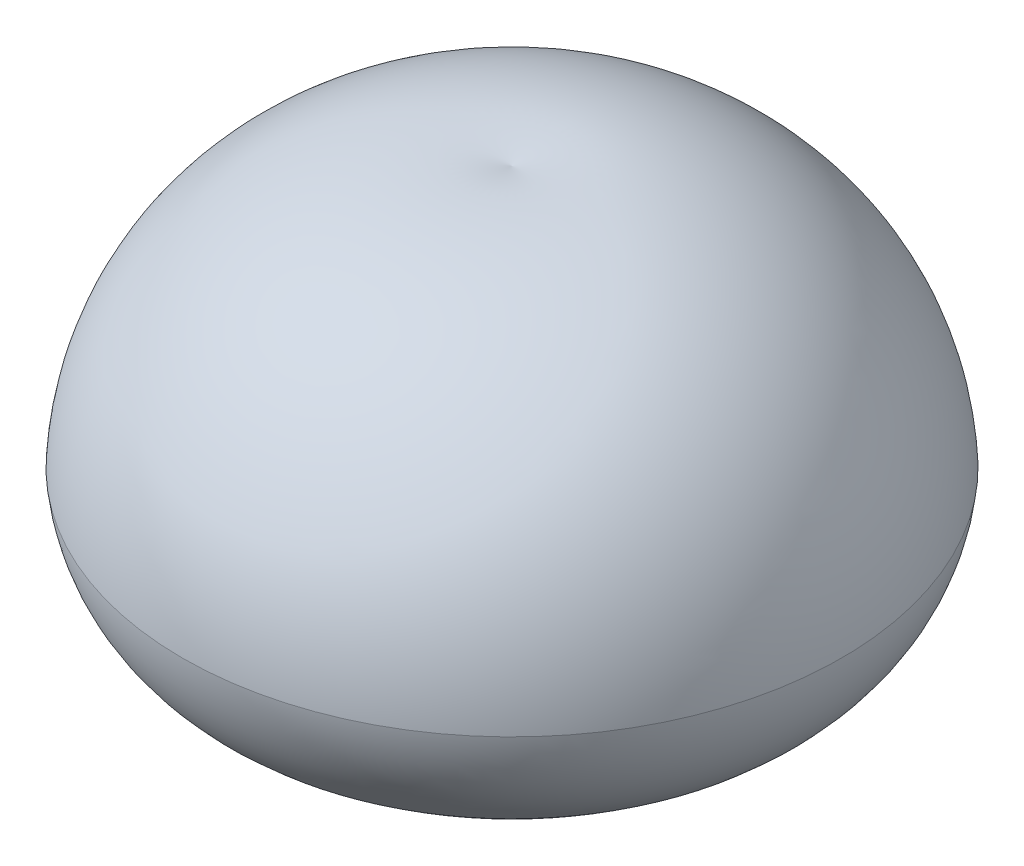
ISO-10303-21;
HEADER;
FILE_DESCRIPTION(('STEP AP214'),'2;1');
FILE_NAME('part.step','',(''),(''),'','','');
FILE_SCHEMA(('AUTOMOTIVE_DESIGN { 1 0 10303 214 1 1 1 1 }'));
ENDSEC;
DATA;
#1=APPLICATION_CONTEXT('core data for automotive mechanical design processes');
#2=APPLICATION_PROTOCOL_DEFINITION('international standard','automotive_design',2000,#1);
#3=PRODUCT_CONTEXT('',#1,'mechanical');
#4=PRODUCT('Part','Part','',(#3));
#5=PRODUCT_RELATED_PRODUCT_CATEGORY('part','',(#4));
#6=PRODUCT_DEFINITION_FORMATION('','',#4);
#7=PRODUCT_DEFINITION_CONTEXT('part definition',#1,'design');
#8=PRODUCT_DEFINITION('design','',#6,#7);
#9=PRODUCT_DEFINITION_SHAPE('','',#8);
#10=(LENGTH_UNIT() NAMED_UNIT(*) SI_UNIT(.MILLI.,.METRE.));
#11=(NAMED_UNIT(*) PLANE_ANGLE_UNIT() SI_UNIT($,.RADIAN.));
#12=(NAMED_UNIT(*) SI_UNIT($,.STERADIAN.) SOLID_ANGLE_UNIT());
#13=UNCERTAINTY_MEASURE_WITH_UNIT(LENGTH_MEASURE(1.E-05),#10,'distance_accuracy_value','');
#14=(GEOMETRIC_REPRESENTATION_CONTEXT(3) GLOBAL_UNCERTAINTY_ASSIGNED_CONTEXT((#13)) GLOBAL_UNIT_ASSIGNED_CONTEXT((#10,
#11,#12)) REPRESENTATION_CONTEXT('',''));
#15=CARTESIAN_POINT('',(0.,0.,0.));
#16=DIRECTION('',(0.,0.,1.));
#17=DIRECTION('',(1.,0.,0.));
#18=AXIS2_PLACEMENT_3D('',#15,#16,#17);
#19=CARTESIAN_POINT('',(0.,1140.,-460.));
#20=DIRECTION('',(-1.,0.,0.));
#21=DIRECTION('',(0.,0.,-1.));
#22=AXIS2_PLACEMENT_3D('',#19,#20,#21);
#23=CIRCLE('',#22,2545.18856317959);
#24=TRIMMED_CURVE('',#23,(PARAMETER_VALUE(-1.7525281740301)),(PARAMETER_VALUE(1.7525281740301)),
.T.,.PARAMETER.);
#25=CARTESIAN_POINT('',(0.,1140.,0.));
#26=DIRECTION('',(0.,-1.,0.));
#27=AXIS1_PLACEMENT('',#25,#26);
#28=SURFACE_OF_REVOLUTION('',#24,#27);
#29=CARTESIAN_POINT('',(0.,1261.13060059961,0.));
#30=DIRECTION('',(0.,-1.,0.));
#31=DIRECTION('',(0.,0.,-1.));
#32=AXIS2_PLACEMENT_3D('',#29,#30,#31);
#33=CIRCLE('',#32,3002.30450570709);
#34=CARTESIAN_POINT('',(0.,1261.13060059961,-3002.30450570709));
#35=VERTEX_POINT('',#34);
#36=EDGE_CURVE('E10',#35,#35,#33,.T.);
#37=ORIENTED_EDGE('',*,*,#36,.F.);
#38=EDGE_LOOP('',(#37));
#39=FACE_BOUND('',#38,.T.);
#40=CARTESIAN_POINT('',(0.,3643.27481953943,0.));
#41=VERTEX_POINT('',#40);
#42=VERTEX_LOOP('',#41);
#43=FACE_BOUND('',#42,.T.);
#44=ADVANCED_FACE('F16',(#39,#43),#28,.T.);
#45=CARTESIAN_POINT('',(0.,1411.75999735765,0.));
#46=DIRECTION('',(0.,-1.,0.));
#47=DIRECTION('',(0.,0.,-1.));
#48=AXIS2_PLACEMENT_3D('',#45,#46,#47);
#49=DEGENERATE_TOROIDAL_SURFACE('',#48,1474.22211760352,1535.48852161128,.T.);
#50=CARTESIAN_POINT('',(0.,90.5057636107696,0.));
#51=DIRECTION('',(0.,-1.,0.));
#52=DIRECTION('',(0.,0.,-1.));
#53=AXIS2_PLACEMENT_3D('',#50,#51,#52);
#54=CIRCLE('',#53,691.909999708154);
#55=CARTESIAN_POINT('',(0.,90.5057636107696,-691.909999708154));
#56=VERTEX_POINT('',#55);
#57=EDGE_CURVE('E23',#56,#56,#54,.T.);
#58=ORIENTED_EDGE('',*,*,#57,.F.);
#59=EDGE_LOOP('',(#58));
#60=FACE_BOUND('',#59,.T.);
#61=ORIENTED_EDGE('',*,*,#36,.T.);
#62=EDGE_LOOP('',(#61));
#63=FACE_BOUND('',#62,.T.);
#64=ADVANCED_FACE('F47',(#60,#63),#49,.T.);
#65=CARTESIAN_POINT('',(0.,90.5057636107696,0.));
#66=DIRECTION('',(0.,-1.,0.));
#67=DIRECTION('',(0.,0.,-1.));
#68=AXIS2_PLACEMENT_3D('',#65,#66,#67);
#69=CONICAL_SURFACE('',#68,691.909999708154,0.35779249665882);
#70=CARTESIAN_POINT('',(0.,279.035470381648,0.));
#71=DIRECTION('',(0.,-1.,0.));
#72=DIRECTION('',(0.,0.,-1.));
#73=AXIS2_PLACEMENT_3D('',#70,#71,#72);
#74=CIRCLE('',#73,621.421630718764);
#75=CARTESIAN_POINT('',(0.,279.035470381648,-621.421630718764));
#76=VERTEX_POINT('',#75);
#77=EDGE_CURVE('E38',#76,#76,#74,.T.);
#78=ORIENTED_EDGE('',*,*,#77,.F.);
#79=EDGE_LOOP('',(#78));
#80=FACE_BOUND('',#79,.T.);
#81=ORIENTED_EDGE('',*,*,#57,.T.);
#82=EDGE_LOOP('',(#81));
#83=FACE_BOUND('',#82,.T.);
#84=ADVANCED_FACE('F45',(#80,#83),#69,.F.);
#85=CARTESIAN_POINT('',(0.,1140.,0.));
#86=DIRECTION('',(0.,-1.,0.));
#87=DIRECTION('',(0.,0.,-1.));
#88=AXIS2_PLACEMENT_3D('',#85,#86,#87);
#89=DEGENERATE_TOROIDAL_SURFACE('',#88,460.,875.966245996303,.T.);
#90=CARTESIAN_POINT('',(0.,1895.68029704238,0.));
#91=DIRECTION('',(0.,-1.,0.));
#92=DIRECTION('',(0.,0.,-1.));
#93=AXIS2_PLACEMENT_3D('',#90,#91,#92);
#94=CIRCLE('',#93,903.017102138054);
#95=CARTESIAN_POINT('',(0.,1895.68029704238,-903.017102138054));
#96=VERTEX_POINT('',#95);
#97=EDGE_CURVE('E36',#96,#96,#94,.T.);
#98=ORIENTED_EDGE('',*,*,#97,.F.);
#99=EDGE_LOOP('',(#98));
#100=FACE_BOUND('',#99,.T.);
#101=ORIENTED_EDGE('',*,*,#77,.T.);
#102=EDGE_LOOP('',(#101));
#103=FACE_BOUND('',#102,.T.);
#104=ADVANCED_FACE('F32',(#100,#103),#89,.F.);
#105=CARTESIAN_POINT('',(0.,1411.75999735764,554.222117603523));
#106=DIRECTION('',(-1.,0.,0.));
#107=DIRECTION('',(0.,0.,-1.));
#108=AXIS2_PLACEMENT_3D('',#105,#106,#107);
#109=CIRCLE('',#108,1535.48852161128);
#110=TRIMMED_CURVE('',#109,(PARAMETER_VALUE(-1.20151866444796)),
(PARAMETER_VALUE(1.20151866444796)),.T.,.PARAMETER.);
#111=CARTESIAN_POINT('',(0.,1411.75999735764,0.));
#112=DIRECTION('',(0.,-1.,0.));
#113=AXIS1_PLACEMENT('',#111,#112);
#114=SURFACE_OF_REVOLUTION('',#110,#113);
#115=CARTESIAN_POINT('',(-1.11022302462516E-13,2843.73864397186,0.));
#116=VERTEX_POINT('',#115);
#117=VERTEX_LOOP('',#116);
#118=FACE_BOUND('',#117,.T.);
#119=ORIENTED_EDGE('',*,*,#97,.T.);
#120=EDGE_LOOP('',(#119));
#121=FACE_BOUND('',#120,.T.);
#122=ADVANCED_FACE('F29',(#118,#121),#114,.F.);
#123=CLOSED_SHELL('',(#44,#64,#84,#104,#122));
#124=MANIFOLD_SOLID_BREP('B1',#123);
#125=ADVANCED_BREP_SHAPE_REPRESENTATION('',(#18,#124),#14);
#126=SHAPE_DEFINITION_REPRESENTATION(#9,#125);
ENDSEC;
END-ISO-10303-21;
